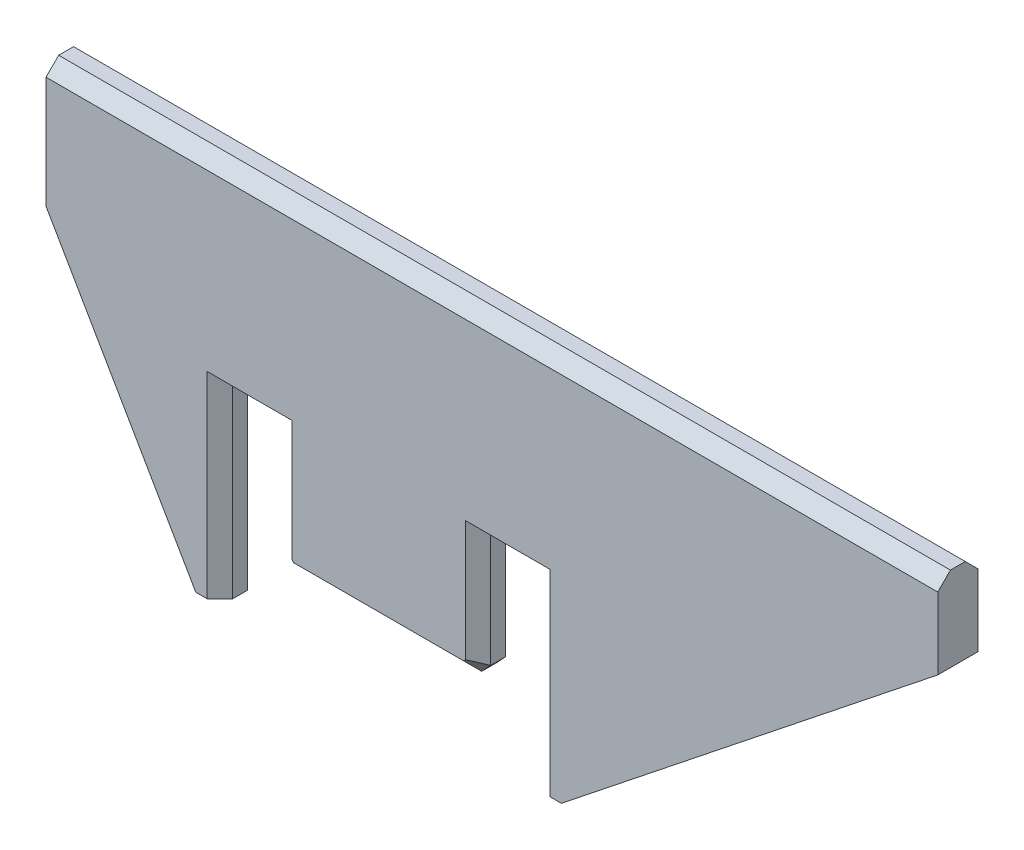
from build123d import *

# Parameters (mm, degrees)
BOSS_EXTRUDE1_DEPTH = 31.75
CHAMFER1_SIZE       = 20
CHAMFER2_SIZE       = 20


with BuildPart() as part:
    # Sketch2 → Boss-Extrude1 (new, symmetric)
    with BuildSketch(Plane(origin=(0, 0, 0), x_dir=(0, 1, 0), z_dir=(0, 0, 1))):
        Polygon((320, 524.878159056), (320, -882.496500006), (186.669332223, -882.496500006), (-285.82, -288.496), (-285.82, -250.396), (5, -250.396), (5, -157.02), (-172.974, -157.02), (-188.214, -142.78), (-188.214, 142.78), (-172.974, 157.02), (5, 157.02), (5, 250.396), (-285.82, 250.396), (-285.82, 288.496), (123.605909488, 524.878159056), align=None)
    extrude(amount=BOSS_EXTRUDE1_DEPTH, both=True)

    # Chamfer1
    chamfer1_edges = [part.edges().sort_by_distance(p)[0] for p in [
        (-250.396, -140.41, 31.75),
        (-203.708, 5, 31.75),
        (-157.02, -83.987, 31.75),
        (-149.9, -180.594, 31.75),
        (0, -188.214, 31.75),
        (149.9, -180.594, 31.75),
        (157.02, -83.987, 31.75),
        (203.708, 5, 31.75),
        (250.396, -140.41, 31.75),
        (178.809170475, 320, 31.75),
    ]]
    chamfer(chamfer1_edges, length=CHAMFER1_SIZE)

    # Chamfer2
    chamfer2_edges = [part.edges().sort_by_distance(p)[0] for p in [
        (250.396, -140.41, -31.75),
        (203.708, 5, -31.75),
        (157.02, -83.987, -31.75),
        (149.9, -180.594, -31.75),
        (0, -188.214, -31.75),
        (-149.9, -180.594, -31.75),
        (-157.02, -83.987, -31.75),
        (-203.708, 5, -31.75),
        (-250.396, -140.41, -31.75),
        (178.809170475, 320, -31.75),
    ]]
    chamfer(chamfer2_edges, length=CHAMFER2_SIZE)


solid = part.part
